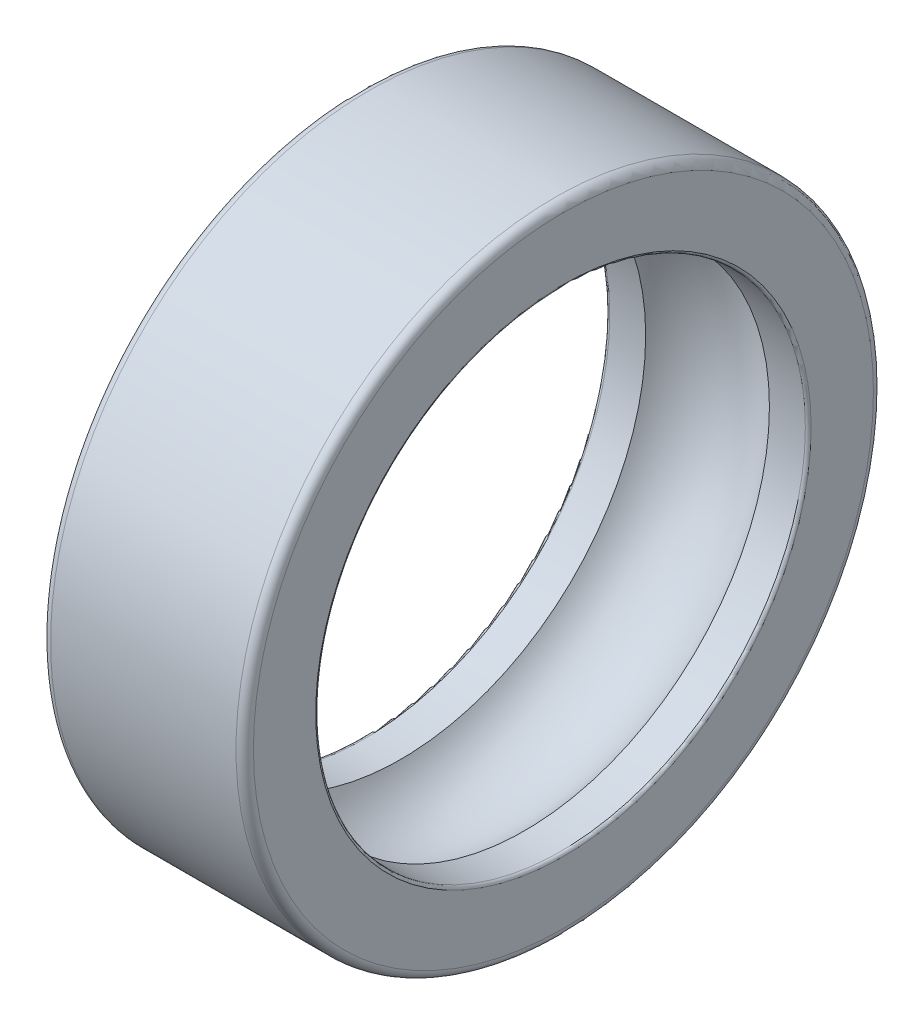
ISO-10303-21;
HEADER;
FILE_DESCRIPTION(('STEP AP214'),'2;1');
FILE_NAME('part.step','',(''),(''),'','','');
FILE_SCHEMA(('AUTOMOTIVE_DESIGN { 1 0 10303 214 1 1 1 1 }'));
ENDSEC;
DATA;
#1=APPLICATION_CONTEXT('core data for automotive mechanical design processes');
#2=APPLICATION_PROTOCOL_DEFINITION('international standard','automotive_design',2000,#1);
#3=PRODUCT_CONTEXT('',#1,'mechanical');
#4=PRODUCT('Part','Part','',(#3));
#5=PRODUCT_RELATED_PRODUCT_CATEGORY('part','',(#4));
#6=PRODUCT_DEFINITION_FORMATION('','',#4);
#7=PRODUCT_DEFINITION_CONTEXT('part definition',#1,'design');
#8=PRODUCT_DEFINITION('design','',#6,#7);
#9=PRODUCT_DEFINITION_SHAPE('','',#8);
#10=(LENGTH_UNIT() NAMED_UNIT(*) SI_UNIT(.MILLI.,.METRE.));
#11=(NAMED_UNIT(*) PLANE_ANGLE_UNIT() SI_UNIT($,.RADIAN.));
#12=(NAMED_UNIT(*) SI_UNIT($,.STERADIAN.) SOLID_ANGLE_UNIT());
#13=UNCERTAINTY_MEASURE_WITH_UNIT(LENGTH_MEASURE(1.E-05),#10,'distance_accuracy_value','');
#14=(GEOMETRIC_REPRESENTATION_CONTEXT(3) GLOBAL_UNCERTAINTY_ASSIGNED_CONTEXT((#13)) GLOBAL_UNIT_ASSIGNED_CONTEXT((#10,
#11,#12)) REPRESENTATION_CONTEXT('',''));
#15=CARTESIAN_POINT('',(0.,0.,0.));
#16=DIRECTION('',(0.,0.,1.));
#17=DIRECTION('',(1.,0.,0.));
#18=AXIS2_PLACEMENT_3D('',#15,#16,#17);
#19=CARTESIAN_POINT('',(0.275000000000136,0.,0.));
#20=DIRECTION('',(1.,0.,0.));
#21=DIRECTION('',(0.,0.,-1.));
#22=AXIS2_PLACEMENT_3D('',#19,#20,#21);
#23=TOROIDAL_SURFACE('',#22,10.7000000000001,0.299999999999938);
#24=CARTESIAN_POINT('',(-0.0249999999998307,0.,0.));
#25=DIRECTION('',(1.,0.,0.));
#26=DIRECTION('',(0.,0.,-1.));
#27=AXIS2_PLACEMENT_3D('',#24,#25,#26);
#28=CIRCLE('',#27,10.7000000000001);
#29=CARTESIAN_POINT('',(-0.0249999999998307,0.,-10.7000000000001));
#30=VERTEX_POINT('',#29);
#31=EDGE_CURVE('E10',#30,#30,#28,.T.);
#32=ORIENTED_EDGE('',*,*,#31,.T.);
#33=EDGE_LOOP('',(#32));
#34=FACE_BOUND('',#33,.T.);
#35=CARTESIAN_POINT('',(0.275000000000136,0.,0.));
#36=DIRECTION('',(1.,0.,0.));
#37=DIRECTION('',(0.,0.,-1.));
#38=AXIS2_PLACEMENT_3D('',#35,#36,#37);
#39=CIRCLE('',#38,11.);
#40=CARTESIAN_POINT('',(0.275000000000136,0.,-11.));
#41=VERTEX_POINT('',#40);
#42=EDGE_CURVE('E70',#41,#41,#39,.T.);
#43=ORIENTED_EDGE('',*,*,#42,.F.);
#44=EDGE_LOOP('',(#43));
#45=FACE_BOUND('',#44,.T.);
#46=ADVANCED_FACE('F36',(#34,#45),#23,.T.);
#47=CARTESIAN_POINT('',(-0.024999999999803,10.7000000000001,0.));
#48=DIRECTION('',(-1.,0.,0.));
#49=DIRECTION('',(0.,0.,1.));
#50=AXIS2_PLACEMENT_3D('',#47,#48,#49);
#51=PLANE('',#50);
#52=CARTESIAN_POINT('',(-0.0249999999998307,0.,0.));
#53=DIRECTION('',(1.,0.,0.));
#54=DIRECTION('',(0.,0.,-1.));
#55=AXIS2_PLACEMENT_3D('',#52,#53,#54);
#56=CIRCLE('',#55,8.59999999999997);
#57=CARTESIAN_POINT('',(-0.0249999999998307,0.,-8.59999999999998));
#58=VERTEX_POINT('',#57);
#59=EDGE_CURVE('E42',#58,#58,#56,.T.);
#60=ORIENTED_EDGE('',*,*,#59,.T.);
#61=EDGE_LOOP('',(#60));
#62=FACE_BOUND('',#61,.T.);
#63=ORIENTED_EDGE('',*,*,#31,.F.);
#64=EDGE_LOOP('',(#63));
#65=FACE_BOUND('',#64,.T.);
#66=ADVANCED_FACE('F78',(#62,#65),#51,.T.);
#67=CARTESIAN_POINT('',(0.125000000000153,0.,0.));
#68=DIRECTION('',(1.,0.,0.));
#69=DIRECTION('',(0.,0.,-1.));
#70=AXIS2_PLACEMENT_3D('',#67,#68,#69);
#71=TOROIDAL_SURFACE('',#70,8.59999999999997,0.149999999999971);
#72=CARTESIAN_POINT('',(0.125000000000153,0.,0.));
#73=DIRECTION('',(1.,0.,0.));
#74=DIRECTION('',(0.,0.,-1.));
#75=AXIS2_PLACEMENT_3D('',#72,#73,#74);
#76=CIRCLE('',#75,8.45);
#77=CARTESIAN_POINT('',(0.125000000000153,0.,-8.45000000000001));
#78=VERTEX_POINT('',#77);
#79=EDGE_CURVE('E46',#78,#78,#76,.T.);
#80=ORIENTED_EDGE('',*,*,#79,.T.);
#81=EDGE_LOOP('',(#80));
#82=FACE_BOUND('',#81,.T.);
#83=ORIENTED_EDGE('',*,*,#59,.F.);
#84=EDGE_LOOP('',(#83));
#85=FACE_BOUND('',#84,.T.);
#86=ADVANCED_FACE('F82',(#82,#85),#71,.T.);
#87=CARTESIAN_POINT('',(9.00000000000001,0.,0.));
#88=DIRECTION('',(1.,0.,0.));
#89=DIRECTION('',(0.,0.,-1.));
#90=AXIS2_PLACEMENT_3D('',#87,#88,#89);
#91=CYLINDRICAL_SURFACE('',#90,8.45);
#92=CARTESIAN_POINT('',(1.36458434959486,0.,0.));
#93=DIRECTION('',(1.,0.,0.));
#94=DIRECTION('',(0.,0.,-1.));
#95=AXIS2_PLACEMENT_3D('',#92,#93,#94);
#96=CIRCLE('',#95,8.45);
#97=CARTESIAN_POINT('',(1.36458434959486,0.,-8.45000000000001));
#98=VERTEX_POINT('',#97);
#99=EDGE_CURVE('E50',#98,#98,#96,.T.);
#100=ORIENTED_EDGE('',*,*,#99,.T.);
#101=EDGE_LOOP('',(#100));
#102=FACE_BOUND('',#101,.T.);
#103=ORIENTED_EDGE('',*,*,#79,.F.);
#104=EDGE_LOOP('',(#103));
#105=FACE_BOUND('',#104,.T.);
#106=ADVANCED_FACE('F86',(#102,#105),#91,.F.);
#107=CARTESIAN_POINT('',(3.5000000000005,0.,0.));
#108=DIRECTION('',(1.,0.,0.));
#109=DIRECTION('',(0.,0.,-1.));
#110=AXIS2_PLACEMENT_3D('',#107,#108,#109);
#111=TOROIDAL_SURFACE('',#110,7.14999999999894,2.50000000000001);
#112=CARTESIAN_POINT('',(5.63541565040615,0.,0.));
#113=DIRECTION('',(1.,0.,0.));
#114=DIRECTION('',(0.,0.,-1.));
#115=AXIS2_PLACEMENT_3D('',#112,#113,#114);
#116=CIRCLE('',#115,8.45);
#117=CARTESIAN_POINT('',(5.63541565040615,0.,-8.45000000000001));
#118=VERTEX_POINT('',#117);
#119=EDGE_CURVE('E55',#118,#118,#116,.T.);
#120=ORIENTED_EDGE('',*,*,#119,.T.);
#121=EDGE_LOOP('',(#120));
#122=FACE_BOUND('',#121,.T.);
#123=ORIENTED_EDGE('',*,*,#99,.F.);
#124=EDGE_LOOP('',(#123));
#125=FACE_BOUND('',#124,.T.);
#126=ADVANCED_FACE('F93',(#122,#125),#111,.F.);
#127=CARTESIAN_POINT('',(9.00000000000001,0.,0.));
#128=DIRECTION('',(1.,0.,0.));
#129=DIRECTION('',(0.,0.,-1.));
#130=AXIS2_PLACEMENT_3D('',#127,#128,#129);
#131=CYLINDRICAL_SURFACE('',#130,8.45);
#132=CARTESIAN_POINT('',(6.87500000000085,0.,0.));
#133=DIRECTION('',(1.,0.,0.));
#134=DIRECTION('',(0.,0.,-1.));
#135=AXIS2_PLACEMENT_3D('',#132,#133,#134);
#136=CIRCLE('',#135,8.45);
#137=CARTESIAN_POINT('',(6.87500000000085,0.,-8.45000000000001));
#138=VERTEX_POINT('',#137);
#139=EDGE_CURVE('E58',#138,#138,#136,.T.);
#140=ORIENTED_EDGE('',*,*,#139,.T.);
#141=EDGE_LOOP('',(#140));
#142=FACE_BOUND('',#141,.T.);
#143=ORIENTED_EDGE('',*,*,#119,.F.);
#144=EDGE_LOOP('',(#143));
#145=FACE_BOUND('',#144,.T.);
#146=ADVANCED_FACE('F97',(#142,#145),#131,.F.);
#147=CARTESIAN_POINT('',(6.87500000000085,0.,0.));
#148=DIRECTION('',(1.,0.,0.));
#149=DIRECTION('',(0.,0.,-1.));
#150=AXIS2_PLACEMENT_3D('',#147,#148,#149);
#151=TOROIDAL_SURFACE('',#150,8.54999999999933,0.0999999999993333);
#152=CARTESIAN_POINT('',(6.97500000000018,0.,0.));
#153=DIRECTION('',(1.,0.,0.));
#154=DIRECTION('',(0.,0.,-1.));
#155=AXIS2_PLACEMENT_3D('',#152,#153,#154);
#156=CIRCLE('',#155,8.54999999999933);
#157=CARTESIAN_POINT('',(6.97500000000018,0.,-8.54999999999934));
#158=VERTEX_POINT('',#157);
#159=EDGE_CURVE('E61',#158,#158,#156,.T.);
#160=ORIENTED_EDGE('',*,*,#159,.T.);
#161=EDGE_LOOP('',(#160));
#162=FACE_BOUND('',#161,.T.);
#163=ORIENTED_EDGE('',*,*,#139,.F.);
#164=EDGE_LOOP('',(#163));
#165=FACE_BOUND('',#164,.T.);
#166=ADVANCED_FACE('F101',(#162,#165),#151,.T.);
#167=CARTESIAN_POINT('',(6.97500000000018,8.54999999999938,0.));
#168=DIRECTION('',(1.,0.,0.));
#169=DIRECTION('',(0.,0.,-1.));
#170=AXIS2_PLACEMENT_3D('',#167,#168,#169);
#171=PLANE('',#170);
#172=CARTESIAN_POINT('',(6.97500000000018,0.,0.));
#173=DIRECTION('',(1.,0.,0.));
#174=DIRECTION('',(0.,0.,-1.));
#175=AXIS2_PLACEMENT_3D('',#172,#173,#174);
#176=CIRCLE('',#175,10.7000000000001);
#177=CARTESIAN_POINT('',(6.97500000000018,0.,-10.7000000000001));
#178=VERTEX_POINT('',#177);
#179=EDGE_CURVE('E64',#178,#178,#176,.T.);
#180=ORIENTED_EDGE('',*,*,#179,.T.);
#181=EDGE_LOOP('',(#180));
#182=FACE_BOUND('',#181,.T.);
#183=ORIENTED_EDGE('',*,*,#159,.F.);
#184=EDGE_LOOP('',(#183));
#185=FACE_BOUND('',#184,.T.);
#186=ADVANCED_FACE('F105',(#182,#185),#171,.T.);
#187=CARTESIAN_POINT('',(6.67500000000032,0.,0.));
#188=DIRECTION('',(1.,0.,0.));
#189=DIRECTION('',(0.,0.,-1.));
#190=AXIS2_PLACEMENT_3D('',#187,#188,#189);
#191=TOROIDAL_SURFACE('',#190,10.7000000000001,0.299999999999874);
#192=CARTESIAN_POINT('',(6.67500000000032,0.,0.));
#193=DIRECTION('',(1.,0.,0.));
#194=DIRECTION('',(0.,0.,-1.));
#195=AXIS2_PLACEMENT_3D('',#192,#193,#194);
#196=CIRCLE('',#195,11.);
#197=CARTESIAN_POINT('',(6.67500000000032,0.,-11.));
#198=VERTEX_POINT('',#197);
#199=EDGE_CURVE('E67',#198,#198,#196,.T.);
#200=ORIENTED_EDGE('',*,*,#199,.T.);
#201=EDGE_LOOP('',(#200));
#202=FACE_BOUND('',#201,.T.);
#203=ORIENTED_EDGE('',*,*,#179,.F.);
#204=EDGE_LOOP('',(#203));
#205=FACE_BOUND('',#204,.T.);
#206=ADVANCED_FACE('F109',(#202,#205),#191,.T.);
#207=CARTESIAN_POINT('',(9.00000000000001,0.,0.));
#208=DIRECTION('',(1.,0.,0.));
#209=DIRECTION('',(0.,0.,-1.));
#210=AXIS2_PLACEMENT_3D('',#207,#208,#209);
#211=CYLINDRICAL_SURFACE('',#210,11.);
#212=ORIENTED_EDGE('',*,*,#42,.T.);
#213=EDGE_LOOP('',(#212));
#214=FACE_BOUND('',#213,.T.);
#215=ORIENTED_EDGE('',*,*,#199,.F.);
#216=EDGE_LOOP('',(#215));
#217=FACE_BOUND('',#216,.T.);
#218=ADVANCED_FACE('F74',(#214,#217),#211,.T.);
#219=CLOSED_SHELL('',(#46,#66,#86,#106,#126,#146,#166,#186,#206,#218));
#220=MANIFOLD_SOLID_BREP('B2',#219);
#221=ADVANCED_BREP_SHAPE_REPRESENTATION('',(#18,#220),#14);
#222=SHAPE_DEFINITION_REPRESENTATION(#9,#221);
ENDSEC;
END-ISO-10303-21;
